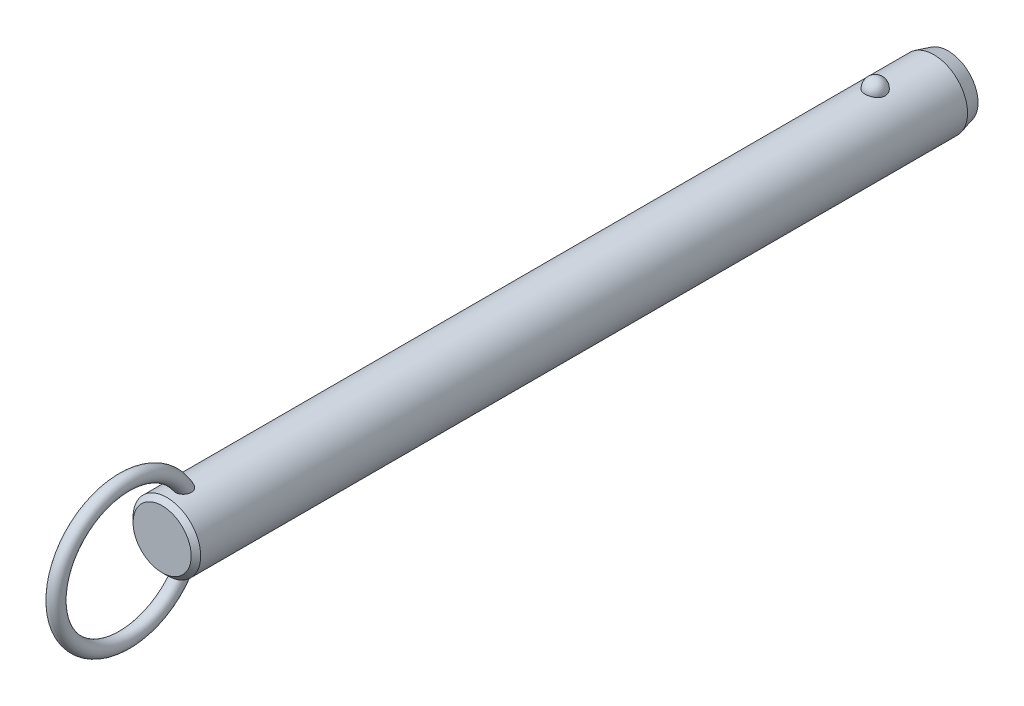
ISO-10303-21;
HEADER;
FILE_DESCRIPTION(('STEP AP214'),'2;1');
FILE_NAME('part.step','',(''),(''),'','','');
FILE_SCHEMA(('AUTOMOTIVE_DESIGN { 1 0 10303 214 1 1 1 1 }'));
ENDSEC;
DATA;
#1=APPLICATION_CONTEXT('core data for automotive mechanical design processes');
#2=APPLICATION_PROTOCOL_DEFINITION('international standard','automotive_design',2000,#1);
#3=PRODUCT_CONTEXT('',#1,'mechanical');
#4=PRODUCT('Part','Part','',(#3));
#5=PRODUCT_RELATED_PRODUCT_CATEGORY('part','',(#4));
#6=PRODUCT_DEFINITION_FORMATION('','',#4);
#7=PRODUCT_DEFINITION_CONTEXT('part definition',#1,'design');
#8=PRODUCT_DEFINITION('design','',#6,#7);
#9=PRODUCT_DEFINITION_SHAPE('','',#8);
#10=(LENGTH_UNIT() NAMED_UNIT(*) SI_UNIT(.MILLI.,.METRE.));
#11=(NAMED_UNIT(*) PLANE_ANGLE_UNIT() SI_UNIT($,.RADIAN.));
#12=(NAMED_UNIT(*) SI_UNIT($,.STERADIAN.) SOLID_ANGLE_UNIT());
#13=UNCERTAINTY_MEASURE_WITH_UNIT(LENGTH_MEASURE(1.E-05),#10,'distance_accuracy_value','');
#14=(GEOMETRIC_REPRESENTATION_CONTEXT(3) GLOBAL_UNCERTAINTY_ASSIGNED_CONTEXT((#13)) GLOBAL_UNIT_ASSIGNED_CONTEXT((#10,
#11,#12)) REPRESENTATION_CONTEXT('',''));
#15=CARTESIAN_POINT('',(0.,0.,0.));
#16=DIRECTION('',(0.,0.,1.));
#17=DIRECTION('',(1.,0.,0.));
#18=AXIS2_PLACEMENT_3D('',#15,#16,#17);
#19=CARTESIAN_POINT('',(0.,0.,139.7));
#20=DIRECTION('',(0.,0.,-1.));
#21=DIRECTION('',(-1.,0.,0.));
#22=AXIS2_PLACEMENT_3D('',#19,#20,#21);
#23=CYLINDRICAL_SURFACE('',#22,7.1);
#24=CARTESIAN_POINT('',(2.0769088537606,6.78943661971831,-2.1));
#25=CARTESIAN_POINT('',(2.07690739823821,6.78943796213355,-1.98268154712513));
#26=CARTESIAN_POINT('',(2.06738130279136,6.79237331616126,-1.86534506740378));
#27=CARTESIAN_POINT('',(2.0295040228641,6.8037853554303,-1.63400788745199));
#28=CARTESIAN_POINT('',(2.00114757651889,6.81226358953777,-1.52000812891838));
#29=CARTESIAN_POINT('',(1.92632025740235,6.83379798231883,-1.29863433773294));
#30=CARTESIAN_POINT('',(1.87985726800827,6.84685214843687,-1.19125744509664));
#31=CARTESIAN_POINT('',(1.76995205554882,6.87608091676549,-0.98604657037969));
#32=CARTESIAN_POINT('',(1.70650980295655,6.8922555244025,-0.88821260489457));
#33=CARTESIAN_POINT('',(1.5638119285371,6.92602930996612,-0.704242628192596));
#34=CARTESIAN_POINT('',(1.4844714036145,6.94363582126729,-0.618173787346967));
#35=CARTESIAN_POINT('',(1.31221746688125,6.97823658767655,-0.460740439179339));
#36=CARTESIAN_POINT('',(1.21930409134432,6.99523084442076,-0.389375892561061));
#37=CARTESIAN_POINT('',(1.02268781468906,7.02666176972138,-0.263547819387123));
#38=CARTESIAN_POINT('',(0.91902009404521,7.04110638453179,-0.209031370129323));
#39=CARTESIAN_POINT('',(0.703548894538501,7.06588726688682,-0.118163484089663));
#40=CARTESIAN_POINT('',(0.591746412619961,7.07622403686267,-0.0818098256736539));
#41=CARTESIAN_POINT('',(0.365557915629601,7.09147068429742,-0.0288711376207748));
#42=CARTESIAN_POINT('',(0.251267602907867,7.09648447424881,-0.0119070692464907));
#43=CARTESIAN_POINT('',(0.0213499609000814,7.10089837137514,0.00304925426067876));
#44=CARTESIAN_POINT('',(-0.0942772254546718,7.10029907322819,0.00104351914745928));
#45=CARTESIAN_POINT('',(-0.321651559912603,7.09360829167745,-0.0216931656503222));
#46=CARTESIAN_POINT('',(-0.433431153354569,7.08760388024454,-0.0421272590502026));
#47=CARTESIAN_POINT('',(-0.651862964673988,7.07086131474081,-0.100729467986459));
#48=CARTESIAN_POINT('',(-0.758515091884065,7.06012307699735,-0.138897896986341));
#49=CARTESIAN_POINT('',(-0.964449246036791,7.03496097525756,-0.232213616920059));
#50=CARTESIAN_POINT('',(-1.06368095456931,7.02051445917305,-0.287465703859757));
#51=CARTESIAN_POINT('',(-1.25145353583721,6.98948740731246,-0.413383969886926));
#52=CARTESIAN_POINT('',(-1.33999321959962,6.97290663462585,-0.48405186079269));
#53=CARTESIAN_POINT('',(-1.50591604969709,6.93898770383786,-0.640594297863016));
#54=CARTESIAN_POINT('',(-1.58302488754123,6.92164094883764,-0.726757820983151));
#55=CARTESIAN_POINT('',(-1.72189320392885,6.8884103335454,-0.91092752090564));
#56=CARTESIAN_POINT('',(-1.78365144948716,6.87252659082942,-1.008934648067));
#57=CARTESIAN_POINT('',(-1.89101272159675,6.84377189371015,-1.21549497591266));
#58=CARTESIAN_POINT('',(-1.93639553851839,6.83094274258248,-1.32416860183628));
#59=CARTESIAN_POINT('',(-2.00874275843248,6.81002070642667,-1.54791500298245));
#60=CARTESIAN_POINT('',(-2.03570774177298,6.80192767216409,-1.66298757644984));
#61=CARTESIAN_POINT('',(-2.07047276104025,6.7914266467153,-1.89571453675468));
#62=CARTESIAN_POINT('',(-2.07835878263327,6.78899315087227,-2.01335491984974));
#63=CARTESIAN_POINT('',(-2.07502083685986,6.79001409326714,-2.24833570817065));
#64=CARTESIAN_POINT('',(-2.06379746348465,6.7934683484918,-2.36567612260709));
#65=CARTESIAN_POINT('',(-2.02263913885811,6.80583442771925,-2.59603194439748));
#66=CARTESIAN_POINT('',(-1.99281127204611,6.81471501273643,-2.70906820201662));
#67=CARTESIAN_POINT('',(-1.91526639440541,6.83691232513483,-2.92836575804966));
#68=CARTESIAN_POINT('',(-1.8675486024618,6.85022924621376,-3.03462676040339));
#69=CARTESIAN_POINT('',(-1.75504492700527,6.87991336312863,-3.23806487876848));
#70=CARTESIAN_POINT('',(-1.69015924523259,6.89629822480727,-3.33518422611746));
#71=CARTESIAN_POINT('',(-1.54505404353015,6.93024852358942,-3.51697105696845));
#72=CARTESIAN_POINT('',(-1.46483385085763,6.94781401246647,-3.60163799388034));
#73=CARTESIAN_POINT('',(-1.29071406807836,6.98225977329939,-3.75654119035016));
#74=CARTESIAN_POINT('',(-1.19675650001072,6.99913673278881,-3.82671308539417));
#75=CARTESIAN_POINT('',(-0.997940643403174,7.03023618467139,-3.9501837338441));
#76=CARTESIAN_POINT('',(-0.89308318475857,7.04445887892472,-4.00348377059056));
#77=CARTESIAN_POINT('',(-0.676902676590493,7.06848365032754,-4.09107242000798));
#78=CARTESIAN_POINT('',(-0.565686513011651,7.0783430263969,-4.12560889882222));
#79=CARTESIAN_POINT('',(-0.338739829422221,7.09282534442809,-4.17575450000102));
#80=CARTESIAN_POINT('',(-0.223009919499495,7.09744899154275,-4.19136617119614));
#81=CARTESIAN_POINT('',(0.00707628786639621,7.10090930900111,-4.20307965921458));
#82=CARTESIAN_POINT('',(0.121410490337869,7.09986531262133,-4.19958377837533));
#83=CARTESIAN_POINT('',(0.347815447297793,7.092380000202,-4.17411564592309));
#84=CARTESIAN_POINT('',(0.459886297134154,7.08593891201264,-4.15214417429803));
#85=CARTESIAN_POINT('',(0.678084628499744,7.06838983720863,-4.09049562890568));
#86=CARTESIAN_POINT('',(0.784237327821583,7.05730369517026,-4.05090137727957));
#87=CARTESIAN_POINT('',(0.988305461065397,7.03163139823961,-3.95511447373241));
#88=CARTESIAN_POINT('',(1.08622031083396,7.01704499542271,-3.89892064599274));
#89=CARTESIAN_POINT('',(1.27284490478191,6.98562668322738,-3.77035541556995));
#90=CARTESIAN_POINT('',(1.36137372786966,6.96876135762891,-3.69772964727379));
#91=CARTESIAN_POINT('',(1.52509486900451,6.93477412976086,-3.53878279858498));
#92=CARTESIAN_POINT('',(1.60028496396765,6.91765218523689,-3.45245943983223));
#93=CARTESIAN_POINT('',(1.73681688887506,6.88465753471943,-3.26658774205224));
#94=CARTESIAN_POINT('',(1.79785966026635,6.86881574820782,-3.16681408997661));
#95=CARTESIAN_POINT('',(1.90265327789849,6.84053157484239,-2.95814408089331));
#96=CARTESIAN_POINT('',(1.94640861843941,6.82808830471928,-2.84925010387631));
#97=CARTESIAN_POINT('',(2.01274378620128,6.80881460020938,-2.63454318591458));
#98=CARTESIAN_POINT('',(2.03676193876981,6.80160856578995,-2.52920574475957));
#99=CARTESIAN_POINT('',(2.06884490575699,6.79191902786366,-2.3159172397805));
#100=CARTESIAN_POINT('',(2.07691019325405,6.78943538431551,-2.20796625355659));
#101=CARTESIAN_POINT('',(2.0769088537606,6.78943661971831,-2.1));
#102=B_SPLINE_CURVE_WITH_KNOTS('',3,(#24,#25,#26,#27,#28,#29,#30,#31,#32,#33,#34,#35,#36,#37,
#38,#39,#40,#41,#42,#43,#44,#45,#46,#47,#48,#49,#50,#51,#52,#53,#54,#55,#56,#57,#58,#59,#60,#61,
#62,#63,#64,#65,#66,#67,#68,#69,#70,#71,#72,#73,#74,#75,#76,#77,#78,#79,#80,#81,#82,#83,#84,#85,
#86,#87,#88,#89,#90,#91,#92,#93,#94,#95,#96,#97,#98,#99,#100,#101),.UNSPECIFIED.,.T.,.F.,(4,2,2,
2,2,2,2,2,2,2,2,2,2,2,2,2,2,2,2,2,2,2,2,2,2,2,2,2,2,2,2,2,2,2,2,2,2,2,4),(0.,0.351568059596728,
0.703234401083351,1.05474780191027,1.40626181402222,1.75970563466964,2.11314851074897,
2.4654696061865,2.81774759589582,3.16301449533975,3.50824481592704,3.84801136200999,
4.18778391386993,4.52968352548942,4.87162112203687,5.22076181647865,5.56993054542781,
5.92363364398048,6.27732559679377,6.62942052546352,6.98150450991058,7.33158042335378,
7.68167162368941,8.03384443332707,8.38603269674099,8.73975272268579,9.09344583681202,
9.44234545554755,9.79119807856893,10.1327344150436,10.4742563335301,10.8141898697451,
11.1541474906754,11.4997793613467,11.8454687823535,12.1979079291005,12.5502553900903,
12.8738073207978,13.1973496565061),.UNSPECIFIED.);
#103=CARTESIAN_POINT('',(2.0769088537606,6.78943661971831,-2.1));
#104=VERTEX_POINT('',#103);
#105=EDGE_CURVE('E41',#104,#104,#102,.T.);
#106=ORIENTED_EDGE('',*,*,#105,.T.);
#107=EDGE_LOOP('',(#106));
#108=FACE_BOUND('',#107,.T.);
#109=CARTESIAN_POINT('',(0.,0.,146.62));
#110=DIRECTION('',(0.,0.,1.));
#111=DIRECTION('',(1.,0.,0.));
#112=AXIS2_PLACEMENT_3D('',#109,#110,#111);
#113=CIRCLE('',#112,7.1);
#114=CARTESIAN_POINT('',(7.1,0.,146.62));
#115=VERTEX_POINT('',#114);
#116=EDGE_CURVE('E10',#115,#115,#113,.F.);
#117=ORIENTED_EDGE('',*,*,#116,.T.);
#118=EDGE_LOOP('',(#117));
#119=FACE_BOUND('',#118,.T.);
#120=CARTESIAN_POINT('',(-0.429539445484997,-7.08699541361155,141.442921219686));
#121=CARTESIAN_POINT('',(-0.508331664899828,-7.08221999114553,141.466876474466));
#122=CARTESIAN_POINT('',(-0.585039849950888,-7.07624016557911,141.497457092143));
#123=CARTESIAN_POINT('',(-0.73208265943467,-7.06254296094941,141.571024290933));
#124=CARTESIAN_POINT('',(-0.802417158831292,-7.05482554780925,141.614011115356));
#125=CARTESIAN_POINT('',(-0.934722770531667,-7.03851844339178,141.711113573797));
#126=CARTESIAN_POINT('',(-0.996700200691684,-7.02992941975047,141.765220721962));
#127=CARTESIAN_POINT('',(-1.11079942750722,-7.01280697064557,141.882967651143));
#128=CARTESIAN_POINT('',(-1.16292136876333,-7.00427354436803,141.946607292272));
#129=CARTESIAN_POINT('',(-1.25705660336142,-6.98799959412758,142.082687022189));
#130=CARTESIAN_POINT('',(-1.29888032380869,-6.98027525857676,142.155259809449));
#131=CARTESIAN_POINT('',(-1.37069920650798,-6.96652886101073,142.306168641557));
#132=CARTESIAN_POINT('',(-1.40069157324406,-6.96050720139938,142.384506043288));
#133=CARTESIAN_POINT('',(-1.45043507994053,-6.95031881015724,142.550190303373));
#134=CARTESIAN_POINT('',(-1.46937115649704,-6.94630231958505,142.637789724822));
#135=CARTESIAN_POINT('',(-1.49424917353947,-6.94099239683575,142.814871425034));
#136=CARTESIAN_POINT('',(-1.50018601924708,-6.93970003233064,142.904354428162));
#137=CARTESIAN_POINT('',(-1.49978214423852,-6.93978815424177,143.094060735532));
#138=CARTESIAN_POINT('',(-1.49187639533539,-6.94150934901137,143.194279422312));
#139=CARTESIAN_POINT('',(-1.46177925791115,-6.94790814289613,143.392479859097));
#140=CARTESIAN_POINT('',(-1.43957541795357,-6.95258831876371,143.490459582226));
#141=CARTESIAN_POINT('',(-1.37783293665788,-6.96510647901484,143.69536292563));
#142=CARTESIAN_POINT('',(-1.33634073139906,-6.97328848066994,143.801680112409));
#143=CARTESIAN_POINT('',(-1.23686994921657,-6.99161706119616,144.006177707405));
#144=CARTESIAN_POINT('',(-1.17889192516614,-7.00176357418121,144.104358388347));
#145=CARTESIAN_POINT('',(-1.0587512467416,-7.02082898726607,144.272374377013));
#146=CARTESIAN_POINT('',(-0.999247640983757,-7.02963746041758,144.344123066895));
#147=CARTESIAN_POINT('',(-0.869494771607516,-7.04686074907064,144.477195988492));
#148=CARTESIAN_POINT('',(-0.799263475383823,-7.05527619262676,144.538537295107));
#149=CARTESIAN_POINT('',(-0.665408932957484,-7.06899457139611,144.635131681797));
#150=CARTESIAN_POINT('',(-0.603817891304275,-7.07457275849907,144.673151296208));
#151=CARTESIAN_POINT('',(-0.475172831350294,-7.08437420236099,144.738758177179));
#152=CARTESIAN_POINT('',(-0.408123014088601,-7.08859848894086,144.766353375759));
#153=CARTESIAN_POINT('',(-0.269431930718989,-7.09522749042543,144.809256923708));
#154=CARTESIAN_POINT('',(-0.197757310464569,-7.09761688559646,144.824461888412));
#155=CARTESIAN_POINT('',(-0.0527849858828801,-7.10017268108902,144.840716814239));
#156=CARTESIAN_POINT('',(0.020511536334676,-7.10034065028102,144.841776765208));
#157=CARTESIAN_POINT('',(0.156426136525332,-7.09855986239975,144.830461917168));
#158=CARTESIAN_POINT('',(0.219199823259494,-7.09688191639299,144.819806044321));
#159=CARTESIAN_POINT('',(0.342134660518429,-7.09201880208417,144.788537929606));
#160=CARTESIAN_POINT('',(0.402295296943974,-7.08883333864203,144.767923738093));
#161=CARTESIAN_POINT('',(0.520687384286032,-7.08113868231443,144.717212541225));
#162=CARTESIAN_POINT('',(0.578791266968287,-7.07658958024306,144.686827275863));
#163=CARTESIAN_POINT('',(0.69017323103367,-7.06659708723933,144.618367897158));
#164=CARTESIAN_POINT('',(0.743447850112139,-7.061153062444,144.580288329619));
#165=CARTESIAN_POINT('',(0.87094790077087,-7.04680292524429,144.476592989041));
#166=CARTESIAN_POINT('',(0.941828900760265,-7.03755800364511,144.406897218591));
#167=CARTESIAN_POINT('',(1.07136606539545,-7.01900793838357,144.256945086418));
#168=CARTESIAN_POINT('',(1.13000013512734,-7.00970271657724,144.176670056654));
#169=CARTESIAN_POINT('',(1.23579584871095,-6.99183327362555,144.006899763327));
#170=CARTESIAN_POINT('',(1.28274271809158,-6.98328455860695,143.917269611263));
#171=CARTESIAN_POINT('',(1.3635144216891,-6.96796352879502,143.732176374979));
#172=CARTESIAN_POINT('',(1.39733971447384,-6.96119115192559,143.636713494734));
#173=CARTESIAN_POINT('',(1.45579181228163,-6.94922464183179,143.42530928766));
#174=CARTESIAN_POINT('',(1.47790145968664,-6.94449000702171,143.308631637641));
#175=CARTESIAN_POINT('',(1.50168752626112,-6.93938731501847,143.073015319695));
#176=CARTESIAN_POINT('',(1.50336085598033,-6.93901991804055,142.95407631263));
#177=CARTESIAN_POINT('',(1.48486516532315,-6.9430010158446,142.72360799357));
#178=CARTESIAN_POINT('',(1.46573441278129,-6.9471253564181,142.611995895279));
#179=CARTESIAN_POINT('',(1.40606892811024,-6.95944667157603,142.394886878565));
#180=CARTESIAN_POINT('',(1.36556446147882,-6.96763788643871,142.2893815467));
#181=CARTESIAN_POINT('',(1.2708270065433,-6.98548038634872,142.104287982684));
#182=CARTESIAN_POINT('',(1.21949810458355,-6.99473841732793,142.023171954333));
#183=CARTESIAN_POINT('',(1.10242050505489,-7.0141406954,141.872227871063));
#184=CARTESIAN_POINT('',(1.03668119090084,-7.02428436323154,141.80239252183));
#185=CARTESIAN_POINT('',(0.900559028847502,-7.04295285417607,141.683573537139));
#186=CARTESIAN_POINT('',(0.831428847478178,-7.05153466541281,141.633157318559));
#187=CARTESIAN_POINT('',(0.685291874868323,-7.06723150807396,141.545142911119));
#188=CARTESIAN_POINT('',(0.608287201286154,-7.07434693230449,141.507541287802));
#189=CARTESIAN_POINT('',(0.451878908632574,-7.08602232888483,141.447491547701));
#190=CARTESIAN_POINT('',(0.372686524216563,-7.09067127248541,141.424508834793));
#191=CARTESIAN_POINT('',(0.211477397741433,-7.09730788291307,141.392035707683));
#192=CARTESIAN_POINT('',(0.129460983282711,-7.09929585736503,141.38254373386));
#193=CARTESIAN_POINT('',(-0.0332905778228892,-7.10037858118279,141.377351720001));
#194=CARTESIAN_POINT('',(-0.114016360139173,-7.09953334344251,141.381365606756));
#195=CARTESIAN_POINT('',(-0.27367033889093,-7.09517338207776,141.402454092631));
#196=CARTESIAN_POINT('',(-0.352598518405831,-7.09165863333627,141.419528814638));
#197=CARTESIAN_POINT('',(-0.429539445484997,-7.08699541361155,141.442921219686));
#198=B_SPLINE_CURVE_WITH_KNOTS('',3,(#120,#121,#122,#123,#124,#125,#126,#127,#128,#129,#130,
#131,#132,#133,#134,#135,#136,#137,#138,#139,#140,#141,#142,#143,#144,#145,#146,#147,#148,#149,
#150,#151,#152,#153,#154,#155,#156,#157,#158,#159,#160,#161,#162,#163,#164,#165,#166,#167,#168,
#169,#170,#171,#172,#173,#174,#175,#176,#177,#178,#179,#180,#181,#182,#183,#184,#185,#186,#187,
#188,#189,#190,#191,#192,#193,#194,#195,#196,#197),.UNSPECIFIED.,.T.,.F.,(4,2,2,2,2,2,2,2,2,2,2,
2,2,2,2,2,2,2,2,2,2,2,2,2,2,2,2,2,2,2,2,2,2,2,2,2,2,2,4),(0.,0.247183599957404,
0.494372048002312,0.741372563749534,0.988369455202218,1.23962059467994,1.490931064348,
1.75897818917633,2.02713035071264,2.3275826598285,2.62829697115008,2.97008736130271,
3.31186629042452,3.59175319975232,3.87117637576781,4.08813841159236,4.30493502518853,
4.5235225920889,4.74195577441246,4.93215328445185,5.12238804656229,5.318848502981,
5.51544871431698,5.81332317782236,6.11173048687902,6.41527266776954,6.71880423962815,
7.07358156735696,7.42841252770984,7.76631485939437,8.10373999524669,8.39142246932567,
8.67891817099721,8.93560332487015,9.19221962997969,9.43881106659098,9.68537399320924,
9.92674752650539,10.1681233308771),.UNSPECIFIED.);
#199=CARTESIAN_POINT('',(-0.429539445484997,-7.08699541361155,141.442921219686));
#200=VERTEX_POINT('',#199);
#201=EDGE_CURVE('E59',#200,#200,#198,.T.);
#202=ORIENTED_EDGE('',*,*,#201,.T.);
#203=EDGE_LOOP('',(#202));
#204=FACE_BOUND('',#203,.T.);
#205=CARTESIAN_POINT('',(-0.429539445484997,7.08699541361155,141.442921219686));
#206=CARTESIAN_POINT('',(-0.351665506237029,7.09171429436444,141.419246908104));
#207=CARTESIAN_POINT('',(-0.271733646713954,7.09525896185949,141.402036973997));
#208=CARTESIAN_POINT('',(-0.110026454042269,7.09960839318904,141.381005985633));
#209=CARTESIAN_POINT('',(-0.0282502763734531,7.10041187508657,141.377191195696));
#210=CARTESIAN_POINT('',(0.134782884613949,7.09918849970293,141.383059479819));
#211=CARTESIAN_POINT('',(0.216039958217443,7.09716214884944,141.39274013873));
#212=CARTESIAN_POINT('',(0.375730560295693,7.09050177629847,141.425347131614));
#213=CARTESIAN_POINT('',(0.454164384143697,7.08586802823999,141.448272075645));
#214=CARTESIAN_POINT('',(0.606025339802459,7.07449911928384,141.506771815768));
#215=CARTESIAN_POINT('',(0.679451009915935,7.06776334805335,141.542350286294));
#216=CARTESIAN_POINT('',(0.81923414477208,7.05292866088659,141.625175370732));
#217=CARTESIAN_POINT('',(0.885591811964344,7.04482978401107,141.672421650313));
#218=CARTESIAN_POINT('',(1.00993211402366,7.02808709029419,141.777590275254));
#219=CARTESIAN_POINT('',(1.06785399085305,7.01943990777,141.835583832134));
#220=CARTESIAN_POINT('',(1.17342527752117,7.00256662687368,141.960301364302));
#221=CARTESIAN_POINT('',(1.22107408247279,6.99434055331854,142.027025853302));
#222=CARTESIAN_POINT('',(1.30652927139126,6.97889183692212,142.169362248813));
#223=CARTESIAN_POINT('',(1.34399711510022,6.97170674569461,142.245180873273));
#224=CARTESIAN_POINT('',(1.40682616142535,6.95930080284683,142.401810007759));
#225=CARTESIAN_POINT('',(1.43218374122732,6.95408053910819,142.48262200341));
#226=CARTESIAN_POINT('',(1.47246409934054,6.94566853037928,142.653531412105));
#227=CARTESIAN_POINT('',(1.48642590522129,6.9426653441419,142.74386307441));
#228=CARTESIAN_POINT('',(1.5011410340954,6.93949744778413,142.925619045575));
#229=CARTESIAN_POINT('',(1.50188917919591,6.93933385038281,143.017043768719));
#230=CARTESIAN_POINT('',(1.49030464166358,6.94183245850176,143.21084381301));
#231=CARTESIAN_POINT('',(1.47627413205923,6.94486147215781,143.313112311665));
#232=CARTESIAN_POINT('',(1.43356351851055,6.95380194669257,143.514471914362));
#233=CARTESIAN_POINT('',(1.4048676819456,6.95971650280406,143.613559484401));
#234=CARTESIAN_POINT('',(1.32908750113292,6.97461208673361,143.818908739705));
#235=CARTESIAN_POINT('',(1.28011435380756,6.98388945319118,143.924456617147));
#236=CARTESIAN_POINT('',(1.16520357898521,7.00397743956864,144.125760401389));
#237=CARTESIAN_POINT('',(1.09927694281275,7.01478706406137,144.221522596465));
#238=CARTESIAN_POINT('',(0.969361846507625,7.03373936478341,144.376756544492));
#239=CARTESIAN_POINT('',(0.909042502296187,7.04187023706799,144.439303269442));
#240=CARTESIAN_POINT('',(0.779178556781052,7.05741732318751,144.554053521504));
#241=CARTESIAN_POINT('',(0.709649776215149,7.06483472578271,144.606274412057));
#242=CARTESIAN_POINT('',(0.576854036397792,7.0767751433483,144.688113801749));
#243=CARTESIAN_POINT('',(0.515118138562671,7.08158033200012,144.720164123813));
#244=CARTESIAN_POINT('',(0.387127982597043,7.08972701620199,144.773765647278));
#245=CARTESIAN_POINT('',(0.320877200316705,7.09306962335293,144.795324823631));
#246=CARTESIAN_POINT('',(0.185041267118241,7.09791507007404,144.826400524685));
#247=CARTESIAN_POINT('',(0.115437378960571,7.09940591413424,144.835838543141));
#248=CARTESIAN_POINT('',(-0.024315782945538,7.10030171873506,144.841522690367));
#249=CARTESIAN_POINT('',(-0.0944648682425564,7.0997073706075,144.837773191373));
#250=CARTESIAN_POINT('',(-0.225713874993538,7.09668414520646,144.818508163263));
#251=CARTESIAN_POINT('',(-0.287006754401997,7.09444865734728,144.804232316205));
#252=CARTESIAN_POINT('',(-0.406555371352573,7.08860360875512,144.766368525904));
#253=CARTESIAN_POINT('',(-0.464809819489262,7.08499346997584,144.742776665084));
#254=CARTESIAN_POINT('',(-0.594955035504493,7.07541654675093,144.678923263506));
#255=CARTESIAN_POINT('',(-0.665389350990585,7.06906574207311,144.635753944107));
#256=CARTESIAN_POINT('',(-0.798242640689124,7.05530261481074,144.538587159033));
#257=CARTESIAN_POINT('',(-0.860645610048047,7.0478882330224,144.484568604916));
#258=CARTESIAN_POINT('',(-0.994249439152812,7.03045217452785,144.350996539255));
#259=CARTESIAN_POINT('',(-1.06260129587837,7.02030745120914,144.268614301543));
#260=CARTESIAN_POINT('',(-1.18502045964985,7.00068382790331,144.093843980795));
#261=CARTESIAN_POINT('',(-1.23907684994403,6.99120544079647,144.001448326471));
#262=CARTESIAN_POINT('',(-1.33335589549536,6.97384343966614,143.808008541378));
#263=CARTESIAN_POINT('',(-1.37336138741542,6.96598557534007,143.706856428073));
#264=CARTESIAN_POINT('',(-1.43770677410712,6.95299053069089,143.499504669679));
#265=CARTESIAN_POINT('',(-1.46204473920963,6.94785368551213,143.39330440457));
#266=CARTESIAN_POINT('',(-1.49537533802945,6.94076296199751,143.168231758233));
#267=CARTESIAN_POINT('',(-1.50273564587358,6.93914842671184,143.04909751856));
#268=CARTESIAN_POINT('',(-1.4954555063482,6.94072368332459,142.811470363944));
#269=CARTESIAN_POINT('',(-1.48082914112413,6.94391040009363,142.692977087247));
#270=CARTESIAN_POINT('',(-1.43076401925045,6.95438579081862,142.473432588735));
#271=CARTESIAN_POINT('',(-1.39762227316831,6.96121852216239,142.371841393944));
#272=CARTESIAN_POINT('',(-1.31211274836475,6.97783941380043,142.177351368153));
#273=CARTESIAN_POINT('',(-1.25976607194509,6.98762432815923,142.08444313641));
#274=CARTESIAN_POINT('',(-1.14583073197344,7.00713153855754,141.924160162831));
#275=CARTESIAN_POINT('',(-1.08665947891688,7.01665982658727,141.855035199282));
#276=CARTESIAN_POINT('',(-0.956606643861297,7.03556646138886,141.728878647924));
#277=CARTESIAN_POINT('',(-0.885737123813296,7.04494495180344,141.671834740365));
#278=CARTESIAN_POINT('',(-0.751558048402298,7.06035735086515,141.583100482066));
#279=CARTESIAN_POINT('',(-0.69012057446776,7.0666695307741,141.548593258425));
#280=CARTESIAN_POINT('',(-0.562815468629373,7.07794609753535,141.488750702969));
#281=CARTESIAN_POINT('',(-0.496948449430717,7.08291067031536,141.463414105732));
#282=CARTESIAN_POINT('',(-0.429539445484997,7.08699541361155,141.442921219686));
#283=B_SPLINE_CURVE_WITH_KNOTS('',3,(#205,#206,#207,#208,#209,#210,#211,#212,#213,#214,#215,
#216,#217,#218,#219,#220,#221,#222,#223,#224,#225,#226,#227,#228,#229,#230,#231,#232,#233,#234,
#235,#236,#237,#238,#239,#240,#241,#242,#243,#244,#245,#246,#247,#248,#249,#250,#251,#252,#253,
#254,#255,#256,#257,#258,#259,#260,#261,#262,#263,#264,#265,#266,#267,#268,#269,#270,#271,#272,
#273,#274,#275,#276,#277,#278,#279,#280,#281,#282),.UNSPECIFIED.,.T.,.F.,(4,2,2,2,2,2,2,2,2,2,2,
2,2,2,2,2,2,2,2,2,2,2,2,2,2,2,2,2,2,2,2,2,2,2,2,2,2,2,4),(0.,0.244335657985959,
0.488785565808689,0.733191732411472,0.977572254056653,1.22202379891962,1.46646834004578,
1.71259457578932,1.9587352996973,2.21226768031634,2.46587585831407,2.73913816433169,
3.01250754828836,3.32109936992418,3.63002293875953,3.9786351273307,4.32702187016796,
4.58793945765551,4.84841449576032,5.05676704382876,5.26496096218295,5.47449661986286,
5.68396281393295,5.87205447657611,6.06022532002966,6.30743751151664,6.55513496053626,
6.87602468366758,7.19715875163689,7.5230577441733,7.84899686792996,8.20516155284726,
8.56109821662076,8.88040084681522,9.19935367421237,9.47236282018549,9.74509220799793,
9.95662250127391,10.1681235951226),.UNSPECIFIED.);
#284=CARTESIAN_POINT('',(-0.429539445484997,7.08699541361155,141.442921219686));
#285=VERTEX_POINT('',#284);
#286=EDGE_CURVE('E67',#285,#285,#283,.T.);
#287=ORIENTED_EDGE('',*,*,#286,.T.);
#288=EDGE_LOOP('',(#287));
#289=FACE_BOUND('',#288,.T.);
#290=CARTESIAN_POINT('',(0.,0.,-14.3999999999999));
#291=DIRECTION('',(0.,0.,-1.));
#292=DIRECTION('',(-1.,0.,0.));
#293=AXIS2_PLACEMENT_3D('',#290,#291,#292);
#294=CIRCLE('',#293,7.1);
#295=CARTESIAN_POINT('',(-7.1,0.,-14.3999999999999));
#296=VERTEX_POINT('',#295);
#297=EDGE_CURVE('E56',#296,#296,#294,.F.);
#298=ORIENTED_EDGE('',*,*,#297,.T.);
#299=EDGE_LOOP('',(#298));
#300=FACE_BOUND('',#299,.T.);
#301=ADVANCED_FACE('F37',(#108,#119,#204,#289,#300),#23,.T.);
#302=CARTESIAN_POINT('',(0.,0.,-17.4));
#303=DIRECTION('',(0.,0.,-1.));
#304=DIRECTION('',(-1.,0.,0.));
#305=AXIS2_PLACEMENT_3D('',#302,#303,#304);
#306=PLANE('',#305);
#307=CARTESIAN_POINT('',(0.,0.,-17.4));
#308=DIRECTION('',(0.,0.,-1.));
#309=DIRECTION('',(-1.,0.,0.));
#310=AXIS2_PLACEMENT_3D('',#307,#308,#309);
#311=CIRCLE('',#310,6.29615242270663);
#312=CARTESIAN_POINT('',(-6.29615242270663,0.,-17.4));
#313=VERTEX_POINT('',#312);
#314=EDGE_CURVE('E66',#313,#313,#311,.T.);
#315=ORIENTED_EDGE('',*,*,#314,.T.);
#316=EDGE_LOOP('',(#315));
#317=FACE_BOUND('',#316,.T.);
#318=ADVANCED_FACE('F85',(#317),#306,.T.);
#319=CARTESIAN_POINT('',(0.,0.,-17.4));
#320=DIRECTION('',(0.,0.,1.));
#321=DIRECTION('',(1.,0.,0.));
#322=AXIS2_PLACEMENT_3D('',#319,#320,#321);
#323=CONICAL_SURFACE('',#322,6.29615242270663,0.261799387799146);
#324=ORIENTED_EDGE('',*,*,#297,.F.);
#325=EDGE_LOOP('',(#324));
#326=FACE_BOUND('',#325,.T.);
#327=ORIENTED_EDGE('',*,*,#314,.F.);
#328=EDGE_LOOP('',(#327));
#329=FACE_BOUND('',#328,.T.);
#330=ADVANCED_FACE('F83',(#326,#329),#323,.T.);
#331=CARTESIAN_POINT('',(0.,0.,147.62));
#332=DIRECTION('',(0.,0.,1.));
#333=DIRECTION('',(1.,0.,0.));
#334=AXIS2_PLACEMENT_3D('',#331,#332,#333);
#335=PLANE('',#334);
#336=CARTESIAN_POINT('',(0.,0.,147.62));
#337=DIRECTION('',(0.,0.,1.));
#338=DIRECTION('',(1.,0.,0.));
#339=AXIS2_PLACEMENT_3D('',#336,#337,#338);
#340=CIRCLE('',#339,6.09999999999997);
#341=CARTESIAN_POINT('',(6.09999999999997,0.,147.62));
#342=VERTEX_POINT('',#341);
#343=EDGE_CURVE('E50',#342,#342,#340,.T.);
#344=ORIENTED_EDGE('',*,*,#343,.T.);
#345=EDGE_LOOP('',(#344));
#346=FACE_BOUND('',#345,.T.);
#347=ADVANCED_FACE('F77',(#346),#335,.T.);
#348=CARTESIAN_POINT('',(0.,0.,155.55));
#349=DIRECTION('',(1.,0.,0.));
#350=DIRECTION('',(0.,0.,-1.));
#351=AXIS2_PLACEMENT_3D('',#348,#349,#350);
#352=TOROIDAL_SURFACE('',#351,14.35,1.5);
#353=ORIENTED_EDGE('',*,*,#286,.F.);
#354=EDGE_LOOP('',(#353));
#355=FACE_BOUND('',#354,.T.);
#356=ORIENTED_EDGE('',*,*,#201,.F.);
#357=EDGE_LOOP('',(#356));
#358=FACE_BOUND('',#357,.T.);
#359=ADVANCED_FACE('F73',(#355,#358),#352,.T.);
#360=CARTESIAN_POINT('',(0.,0.,147.62));
#361=DIRECTION('',(0.,0.,-1.));
#362=DIRECTION('',(-1.,0.,0.));
#363=AXIS2_PLACEMENT_3D('',#360,#361,#362);
#364=CONICAL_SURFACE('',#363,6.09999999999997,0.78539816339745);
#365=ORIENTED_EDGE('',*,*,#116,.F.);
#366=EDGE_LOOP('',(#365));
#367=FACE_BOUND('',#366,.T.);
#368=ORIENTED_EDGE('',*,*,#343,.F.);
#369=EDGE_LOOP('',(#368));
#370=FACE_BOUND('',#369,.T.);
#371=ADVANCED_FACE('F39',(#367,#370),#364,.T.);
#372=CARTESIAN_POINT('',(0.,7.1,-2.1));
#373=DIRECTION('',(0.,1.,0.));
#374=DIRECTION('',(0.,0.,1.));
#375=AXIS2_PLACEMENT_3D('',#372,#373,#374);
#376=SPHERICAL_SURFACE('',#375,2.10000000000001);
#377=ORIENTED_EDGE('',*,*,#105,.F.);
#378=EDGE_LOOP('',(#377));
#379=FACE_BOUND('',#378,.T.);
#380=ADVANCED_FACE('F79',(#379),#376,.T.);
#381=CLOSED_SHELL('',(#301,#318,#330,#347,#359,#371,#380));
#382=MANIFOLD_SOLID_BREP('B2',#381);
#383=ADVANCED_BREP_SHAPE_REPRESENTATION('',(#18,#382),#14);
#384=SHAPE_DEFINITION_REPRESENTATION(#9,#383);
ENDSEC;
END-ISO-10303-21;
